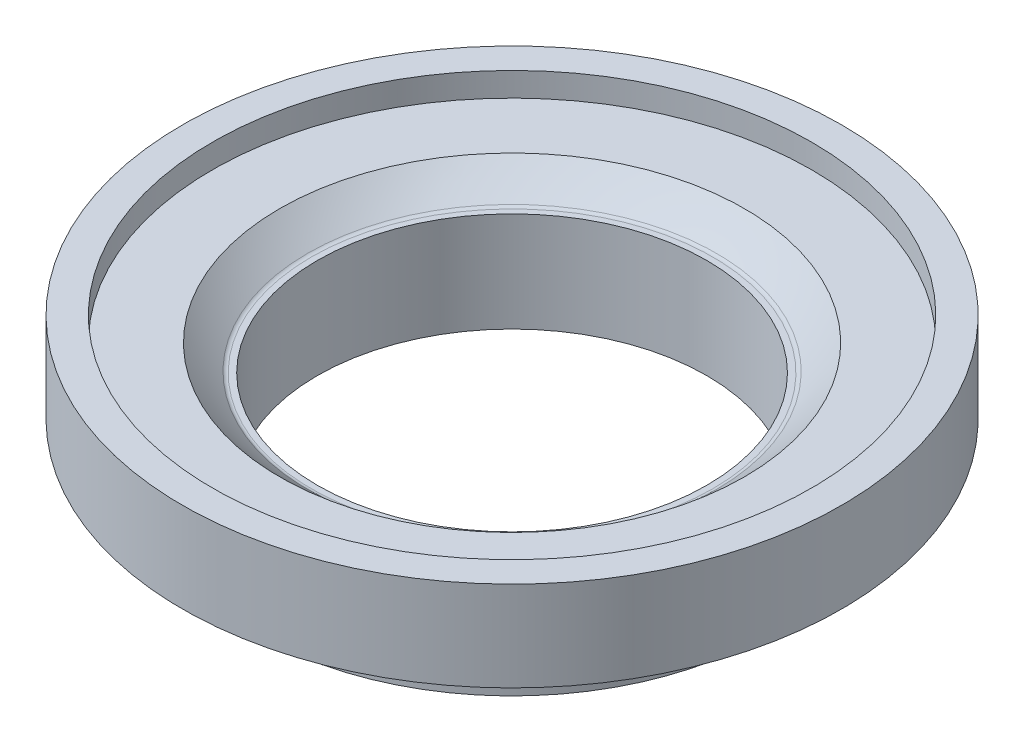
ISO-10303-21;
HEADER;
FILE_DESCRIPTION(('STEP AP214'),'2;1');
FILE_NAME('part.step','',(''),(''),'','','');
FILE_SCHEMA(('AUTOMOTIVE_DESIGN { 1 0 10303 214 1 1 1 1 }'));
ENDSEC;
DATA;
#1=APPLICATION_CONTEXT('core data for automotive mechanical design processes');
#2=APPLICATION_PROTOCOL_DEFINITION('international standard','automotive_design',2000,#1);
#3=PRODUCT_CONTEXT('',#1,'mechanical');
#4=PRODUCT('Part','Part','',(#3));
#5=PRODUCT_RELATED_PRODUCT_CATEGORY('part','',(#4));
#6=PRODUCT_DEFINITION_FORMATION('','',#4);
#7=PRODUCT_DEFINITION_CONTEXT('part definition',#1,'design');
#8=PRODUCT_DEFINITION('design','',#6,#7);
#9=PRODUCT_DEFINITION_SHAPE('','',#8);
#10=(LENGTH_UNIT() NAMED_UNIT(*) SI_UNIT(.MILLI.,.METRE.));
#11=(NAMED_UNIT(*) PLANE_ANGLE_UNIT() SI_UNIT($,.RADIAN.));
#12=(NAMED_UNIT(*) SI_UNIT($,.STERADIAN.) SOLID_ANGLE_UNIT());
#13=UNCERTAINTY_MEASURE_WITH_UNIT(LENGTH_MEASURE(1.E-05),#10,'distance_accuracy_value','');
#14=(GEOMETRIC_REPRESENTATION_CONTEXT(3) GLOBAL_UNCERTAINTY_ASSIGNED_CONTEXT((#13)) GLOBAL_UNIT_ASSIGNED_CONTEXT((#10,
#11,#12)) REPRESENTATION_CONTEXT('',''));
#15=CARTESIAN_POINT('',(0.,0.,0.));
#16=DIRECTION('',(0.,0.,1.));
#17=DIRECTION('',(1.,0.,0.));
#18=AXIS2_PLACEMENT_3D('',#15,#16,#17);
#19=CARTESIAN_POINT('',(0.,0.,0.));
#20=DIRECTION('',(0.,-1.,0.));
#21=DIRECTION('',(0.,0.,-1.));
#22=AXIS2_PLACEMENT_3D('',#19,#20,#21);
#23=CYLINDRICAL_SURFACE('',#22,6.49999999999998);
#24=CARTESIAN_POINT('',(0.,0.,0.));
#25=DIRECTION('',(0.,-1.,0.));
#26=DIRECTION('',(0.,0.,-1.));
#27=AXIS2_PLACEMENT_3D('',#24,#25,#26);
#28=CIRCLE('',#27,6.5);
#29=CARTESIAN_POINT('',(0.,0.,-6.5));
#30=VERTEX_POINT('',#29);
#31=EDGE_CURVE('E59',#30,#30,#28,.T.);
#32=ORIENTED_EDGE('',*,*,#31,.T.);
#33=EDGE_LOOP('',(#32));
#34=FACE_BOUND('',#33,.T.);
#35=CARTESIAN_POINT('',(0.,3.32946282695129,0.));
#36=DIRECTION('',(0.,1.,0.));
#37=DIRECTION('',(-1.,0.,0.));
#38=AXIS2_PLACEMENT_3D('',#35,#36,#37);
#39=CIRCLE('',#38,6.5);
#40=CARTESIAN_POINT('',(-6.5,3.32946282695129,0.));
#41=VERTEX_POINT('',#40);
#42=EDGE_CURVE('E71',#41,#41,#39,.T.);
#43=ORIENTED_EDGE('',*,*,#42,.T.);
#44=EDGE_LOOP('',(#43));
#45=FACE_BOUND('',#44,.T.);
#46=ADVANCED_FACE('F30',(#34,#45),#23,.F.);
#47=CARTESIAN_POINT('',(-8.5,0.,0.));
#48=DIRECTION('',(0.,-1.,0.));
#49=DIRECTION('',(0.,0.,-1.));
#50=AXIS2_PLACEMENT_3D('',#47,#48,#49);
#51=PLANE('',#50);
#52=CARTESIAN_POINT('',(0.,0.,0.));
#53=DIRECTION('',(0.,-1.,0.));
#54=DIRECTION('',(0.,0.,-1.));
#55=AXIS2_PLACEMENT_3D('',#52,#53,#54);
#56=CIRCLE('',#55,8.5);
#57=CARTESIAN_POINT('',(0.,0.,-8.5));
#58=VERTEX_POINT('',#57);
#59=EDGE_CURVE('E10',#58,#58,#56,.T.);
#60=ORIENTED_EDGE('',*,*,#59,.T.);
#61=EDGE_LOOP('',(#60));
#62=FACE_BOUND('',#61,.T.);
#63=ORIENTED_EDGE('',*,*,#31,.F.);
#64=EDGE_LOOP('',(#63));
#65=FACE_BOUND('',#64,.T.);
#66=ADVANCED_FACE('F94',(#62,#65),#51,.T.);
#67=CARTESIAN_POINT('',(0.,0.,0.));
#68=DIRECTION('',(0.,-1.,0.));
#69=DIRECTION('',(0.,0.,-1.));
#70=AXIS2_PLACEMENT_3D('',#67,#68,#69);
#71=CYLINDRICAL_SURFACE('',#70,8.5);
#72=CARTESIAN_POINT('',(0.,1.,0.));
#73=DIRECTION('',(0.,-1.,0.));
#74=DIRECTION('',(0.,0.,-1.));
#75=AXIS2_PLACEMENT_3D('',#72,#73,#74);
#76=CIRCLE('',#75,8.5);
#77=CARTESIAN_POINT('',(0.,1.,-8.5));
#78=VERTEX_POINT('',#77);
#79=EDGE_CURVE('E37',#78,#78,#76,.T.);
#80=ORIENTED_EDGE('',*,*,#79,.T.);
#81=EDGE_LOOP('',(#80));
#82=FACE_BOUND('',#81,.T.);
#83=ORIENTED_EDGE('',*,*,#59,.F.);
#84=EDGE_LOOP('',(#83));
#85=FACE_BOUND('',#84,.T.);
#86=ADVANCED_FACE('F32',(#82,#85),#71,.T.);
#87=CARTESIAN_POINT('',(0.,1.,0.));
#88=DIRECTION('',(0.,1.,0.));
#89=DIRECTION('',(0.,0.,1.));
#90=AXIS2_PLACEMENT_3D('',#87,#88,#89);
#91=CONICAL_SURFACE('',#90,8.5,0.78539816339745);
#92=CARTESIAN_POINT('',(0.,2.,0.));
#93=DIRECTION('',(0.,-1.,0.));
#94=DIRECTION('',(0.,0.,-1.));
#95=AXIS2_PLACEMENT_3D('',#92,#93,#94);
#96=CIRCLE('',#95,9.5);
#97=CARTESIAN_POINT('',(0.,2.,-9.5));
#98=VERTEX_POINT('',#97);
#99=EDGE_CURVE('E41',#98,#98,#96,.T.);
#100=ORIENTED_EDGE('',*,*,#99,.T.);
#101=EDGE_LOOP('',(#100));
#102=FACE_BOUND('',#101,.T.);
#103=ORIENTED_EDGE('',*,*,#79,.F.);
#104=EDGE_LOOP('',(#103));
#105=FACE_BOUND('',#104,.T.);
#106=ADVANCED_FACE('F119',(#102,#105),#91,.T.);
#107=CARTESIAN_POINT('',(-9.5,2.,0.));
#108=DIRECTION('',(0.,-1.,0.));
#109=DIRECTION('',(0.,0.,-1.));
#110=AXIS2_PLACEMENT_3D('',#107,#108,#109);
#111=PLANE('',#110);
#112=CARTESIAN_POINT('',(0.,2.,0.));
#113=DIRECTION('',(0.,-1.,0.));
#114=DIRECTION('',(0.,0.,-1.));
#115=AXIS2_PLACEMENT_3D('',#112,#113,#114);
#116=CIRCLE('',#115,11.);
#117=CARTESIAN_POINT('',(0.,2.,-11.));
#118=VERTEX_POINT('',#117);
#119=EDGE_CURVE('E45',#118,#118,#116,.T.);
#120=ORIENTED_EDGE('',*,*,#119,.T.);
#121=EDGE_LOOP('',(#120));
#122=FACE_BOUND('',#121,.T.);
#123=ORIENTED_EDGE('',*,*,#99,.F.);
#124=EDGE_LOOP('',(#123));
#125=FACE_BOUND('',#124,.T.);
#126=ADVANCED_FACE('F116',(#122,#125),#111,.T.);
#127=CARTESIAN_POINT('',(0.,0.,0.));
#128=DIRECTION('',(0.,-1.,0.));
#129=DIRECTION('',(0.,0.,-1.));
#130=AXIS2_PLACEMENT_3D('',#127,#128,#129);
#131=CYLINDRICAL_SURFACE('',#130,11.);
#132=CARTESIAN_POINT('',(0.,5.,0.));
#133=DIRECTION('',(0.,-1.,0.));
#134=DIRECTION('',(0.,0.,-1.));
#135=AXIS2_PLACEMENT_3D('',#132,#133,#134);
#136=CIRCLE('',#135,11.);
#137=CARTESIAN_POINT('',(0.,5.,-11.));
#138=VERTEX_POINT('',#137);
#139=EDGE_CURVE('E50',#138,#138,#136,.T.);
#140=ORIENTED_EDGE('',*,*,#139,.T.);
#141=EDGE_LOOP('',(#140));
#142=FACE_BOUND('',#141,.T.);
#143=ORIENTED_EDGE('',*,*,#119,.F.);
#144=EDGE_LOOP('',(#143));
#145=FACE_BOUND('',#144,.T.);
#146=ADVANCED_FACE('F112',(#142,#145),#131,.T.);
#147=CARTESIAN_POINT('',(-11.,5.,0.));
#148=DIRECTION('',(0.,1.,0.));
#149=DIRECTION('',(0.,0.,1.));
#150=AXIS2_PLACEMENT_3D('',#147,#148,#149);
#151=PLANE('',#150);
#152=CARTESIAN_POINT('',(0.,5.,0.));
#153=DIRECTION('',(0.,-1.,0.));
#154=DIRECTION('',(0.,0.,-1.));
#155=AXIS2_PLACEMENT_3D('',#152,#153,#154);
#156=CIRCLE('',#155,10.);
#157=CARTESIAN_POINT('',(0.,5.,-10.));
#158=VERTEX_POINT('',#157);
#159=EDGE_CURVE('E53',#158,#158,#156,.T.);
#160=ORIENTED_EDGE('',*,*,#159,.T.);
#161=EDGE_LOOP('',(#160));
#162=FACE_BOUND('',#161,.T.);
#163=ORIENTED_EDGE('',*,*,#139,.F.);
#164=EDGE_LOOP('',(#163));
#165=FACE_BOUND('',#164,.T.);
#166=ADVANCED_FACE('F108',(#162,#165),#151,.T.);
#167=CARTESIAN_POINT('',(0.,0.,0.));
#168=DIRECTION('',(0.,-1.,0.));
#169=DIRECTION('',(0.,0.,-1.));
#170=AXIS2_PLACEMENT_3D('',#167,#168,#169);
#171=CYLINDRICAL_SURFACE('',#170,10.);
#172=CARTESIAN_POINT('',(0.,4.2,0.));
#173=DIRECTION('',(0.,-1.,0.));
#174=DIRECTION('',(0.,0.,-1.));
#175=AXIS2_PLACEMENT_3D('',#172,#173,#174);
#176=CIRCLE('',#175,10.);
#177=CARTESIAN_POINT('',(0.,4.2,-10.));
#178=VERTEX_POINT('',#177);
#179=EDGE_CURVE('E56',#178,#178,#176,.T.);
#180=ORIENTED_EDGE('',*,*,#179,.T.);
#181=EDGE_LOOP('',(#180));
#182=FACE_BOUND('',#181,.T.);
#183=ORIENTED_EDGE('',*,*,#159,.F.);
#184=EDGE_LOOP('',(#183));
#185=FACE_BOUND('',#184,.T.);
#186=ADVANCED_FACE('F104',(#182,#185),#171,.F.);
#187=CARTESIAN_POINT('',(-10.,4.19999999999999,0.));
#188=DIRECTION('',(0.,1.,0.));
#189=DIRECTION('',(0.,0.,1.));
#190=AXIS2_PLACEMENT_3D('',#187,#188,#189);
#191=PLANE('',#190);
#192=CARTESIAN_POINT('',(0.,4.19999999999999,0.));
#193=DIRECTION('',(0.,1.,0.));
#194=DIRECTION('',(0.,0.,1.));
#195=AXIS2_PLACEMENT_3D('',#192,#193,#194);
#196=CIRCLE('',#195,7.75628777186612);
#197=CARTESIAN_POINT('',(7.75628777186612,4.19999999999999,0.));
#198=VERTEX_POINT('',#197);
#199=EDGE_CURVE('E62',#198,#198,#196,.T.);
#200=ORIENTED_EDGE('',*,*,#199,.F.);
#201=EDGE_LOOP('',(#200));
#202=FACE_BOUND('',#201,.T.);
#203=ORIENTED_EDGE('',*,*,#179,.F.);
#204=EDGE_LOOP('',(#203));
#205=FACE_BOUND('',#204,.T.);
#206=ADVANCED_FACE('F90',(#202,#205),#191,.T.);
#207=CARTESIAN_POINT('',(0.,12.,0.));
#208=DIRECTION('',(0.,-1.,0.));
#209=DIRECTION('',(1.,0.,0.));
#210=AXIS2_PLACEMENT_3D('',#207,#208,#209);
#211=SPHERICAL_SURFACE('',#210,11.);
#212=CARTESIAN_POINT('',(0.,3.37260102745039,0.));
#213=DIRECTION('',(0.,1.,0.));
#214=DIRECTION('',(0.,0.,1.));
#215=AXIS2_PLACEMENT_3D('',#212,#213,#214);
#216=CIRCLE('',#215,6.82407407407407);
#217=CARTESIAN_POINT('',(6.82407407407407,3.37260102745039,0.));
#218=VERTEX_POINT('',#217);
#219=EDGE_CURVE('E65',#218,#218,#216,.T.);
#220=CARTESIAN_POINT('',(7.75628777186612,4.19999999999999,0.));
#221=CARTESIAN_POINT('',(7.74707618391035,4.19084003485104,0.));
#222=CARTESIAN_POINT('',(7.73784836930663,4.18169638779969,0.));
#223=CARTESIAN_POINT('',(7.71936040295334,4.16344184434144,0.));
#224=CARTESIAN_POINT('',(7.71010025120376,4.15433094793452,0.));
#225=CARTESIAN_POINT('',(7.69154772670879,4.13614202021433,0.));
#226=CARTESIAN_POINT('',(7.6822553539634,4.12706398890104,0.));
#227=CARTESIAN_POINT('',(7.66363850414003,4.10894090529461,0.));
#228=CARTESIAN_POINT('',(7.65431402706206,4.09989585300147,0.));
#229=CARTESIAN_POINT('',(7.63563308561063,4.0818388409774,0.));
#230=CARTESIAN_POINT('',(7.62627662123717,4.07282688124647,0.));
#231=CARTESIAN_POINT('',(7.60753182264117,4.05483616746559,0.));
#232=CARTESIAN_POINT('',(7.59814348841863,4.04585741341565,0.));
#233=CARTESIAN_POINT('',(7.57933506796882,4.02793322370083,0.));
#234=CARTESIAN_POINT('',(7.56991498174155,4.01898778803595,0.));
#235=CARTESIAN_POINT('',(7.55104317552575,4.00113034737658,0.));
#236=CARTESIAN_POINT('',(7.54159145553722,3.99221834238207,0.));
#237=CARTESIAN_POINT('',(7.5226565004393,3.97442787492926,0.));
#238=CARTESIAN_POINT('',(7.51317326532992,3.96554941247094,0.));
#239=CARTESIAN_POINT('',(7.4941753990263,3.94782614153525,0.));
#240=CARTESIAN_POINT('',(7.48466076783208,3.93898133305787,0.));
#241=CARTESIAN_POINT('',(7.46560022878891,3.92132548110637,0.));
#242=CARTESIAN_POINT('',(7.45605432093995,3.91251443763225,0.));
#243=CARTESIAN_POINT('',(7.43693134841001,3.89492622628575,0.));
#244=CARTESIAN_POINT('',(7.42735428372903,3.88614905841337,0.));
#245=CARTESIAN_POINT('',(7.40816911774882,3.86862870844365,0.));
#246=CARTESIAN_POINT('',(7.3985610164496,3.8598855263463,0.));
#247=CARTESIAN_POINT('',(7.37931389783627,3.8424332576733,0.));
#248=CARTESIAN_POINT('',(7.36967488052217,3.83372417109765,0.));
#249=CARTESIAN_POINT('',(7.35036605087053,3.81634020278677,0.));
#250=CARTESIAN_POINT('',(7.34069623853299,3.80766532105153,0.));
#251=CARTESIAN_POINT('',(7.32132594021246,3.79034987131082,0.));
#252=CARTESIAN_POINT('',(7.31162545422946,3.78170930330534,0.));
#253=CARTESIAN_POINT('',(7.29219393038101,3.76446258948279,0.));
#254=CARTESIAN_POINT('',(7.28246289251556,3.75585644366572,0.));
#255=CARTESIAN_POINT('',(7.2629703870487,3.73867868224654,0.));
#256=CARTESIAN_POINT('',(7.25320891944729,3.73010706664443,0.));
#257=CARTESIAN_POINT('',(7.23365567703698,3.71299847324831,0.));
#258=CARTESIAN_POINT('',(7.22386390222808,3.70446149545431,0.));
#259=CARTESIAN_POINT('',(7.20425016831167,3.68742228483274,0.));
#260=CARTESIAN_POINT('',(7.19442820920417,3.67892005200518,0.));
#261=CARTESIAN_POINT('',(7.17475422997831,3.66195043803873,0.));
#262=CARTESIAN_POINT('',(7.16490220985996,3.65348305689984,0.));
#263=CARTESIAN_POINT('',(7.14516823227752,3.63658325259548,0.));
#264=CARTESIAN_POINT('',(7.13528627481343,3.62815082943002,0.));
#265=CARTESIAN_POINT('',(7.11549254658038,3.61132104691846,0.));
#266=CARTESIAN_POINT('',(7.10558077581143,3.60292368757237,0.));
#267=CARTESIAN_POINT('',(7.08572754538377,3.58616413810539,0.));
#268=CARTESIAN_POINT('',(7.07578608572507,3.5778019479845,0.));
#269=CARTESIAN_POINT('',(7.05587360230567,3.56111284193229,0.));
#270=CARTESIAN_POINT('',(7.04590257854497,3.55278592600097,0.));
#271=CARTESIAN_POINT('',(7.02593109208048,3.53616747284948,0.));
#272=CARTESIAN_POINT('',(7.01593062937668,3.5278759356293,0.));
#273=CARTESIAN_POINT('',(6.99590039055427,3.51132834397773,0.));
#274=CARTESIAN_POINT('',(6.98587061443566,3.50307228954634,0.));
#275=CARTESIAN_POINT('',(6.96578187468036,3.48659576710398,0.));
#276=CARTESIAN_POINT('',(6.95572291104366,3.47837529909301,0.));
#277=CARTESIAN_POINT('',(6.93557592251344,3.46197005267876,0.));
#278=CARTESIAN_POINT('',(6.9254878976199,3.45378527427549,0.));
#279=CARTESIAN_POINT('',(6.90528291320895,3.43745150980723,0.));
#280=CARTESIAN_POINT('',(6.89516595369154,3.42930252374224,0.));
#281=CARTESIAN_POINT('',(6.87490322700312,3.41304044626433,0.));
#282=CARTESIAN_POINT('',(6.86475745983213,3.40492735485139,0.));
#283=CARTESIAN_POINT('',(6.84443724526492,3.38873716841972,0.));
#284=CARTESIAN_POINT('',(6.83426279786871,3.38066007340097,0.));
#285=CARTESIAN_POINT('',(6.82407407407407,3.37260102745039,0.));
#286=B_SPLINE_CURVE_WITH_KNOTS('',3,(#220,#221,#222,#223,#224,#225,#226,#227,#228,#229,#230,
#231,#232,#233,#234,#235,#236,#237,#238,#239,#240,#241,#242,#243,#244,#245,#246,#247,#248,#249,
#250,#251,#252,#253,#254,#255,#256,#257,#258,#259,#260,#261,#262,#263,#264,#265,#266,#267,#268,
#269,#270,#271,#272,#273,#274,#275,#276,#277,#278,#279,#280,#281,#282,#283,#284,#285),
.UNSPECIFIED.,.F.,.F.,(4,2,2,2,2,2,2,2,2,2,2,2,2,2,2,2,2,2,2,2,2,2,2,2,2,2,2,2,2,2,2,2,4),(0.,
0.0389720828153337,0.0779441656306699,0.116916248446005,0.15588833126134,0.194860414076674,
0.233832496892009,0.272804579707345,0.311776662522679,0.350748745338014,0.38972082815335,
0.428692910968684,0.46766499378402,0.506637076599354,0.54560915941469,0.584581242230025,
0.62355332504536,0.662525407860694,0.701497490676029,0.740469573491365,0.779441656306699,
0.818413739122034,0.857385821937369,0.896357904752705,0.93532998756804,0.974302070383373,
1.01327415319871,1.05224623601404,1.09121831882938,1.13019040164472,1.16916248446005,
1.20813456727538,1.24710665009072),.UNSPECIFIED.);
#287=EDGE_CURVE('BSEAM84',#198,#218,#286,.T.);
#288=ORIENTED_EDGE('',*,*,#199,.T.);
#289=ORIENTED_EDGE('',*,*,#219,.F.);
#290=ORIENTED_EDGE('',*,*,#287,.T.);
#291=ORIENTED_EDGE('',*,*,#287,.F.);
#292=EDGE_LOOP('',(#288,#290,#289,#291));
#293=FACE_BOUND('',#292,.T.);
#294=ADVANCED_FACE('F84',(#293),#211,.F.);
#295=CARTESIAN_POINT('',(0.,3.52946282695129,0.));
#296=DIRECTION('',(0.,1.,0.));
#297=DIRECTION('',(0.,0.,1.));
#298=AXIS2_PLACEMENT_3D('',#295,#296,#297);
#299=TOROIDAL_SURFACE('',#298,6.7,0.2);
#300=ORIENTED_EDGE('',*,*,#219,.T.);
#301=EDGE_LOOP('',(#300));
#302=FACE_BOUND('',#301,.T.);
#303=CARTESIAN_POINT('',(0.,3.32946282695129,0.));
#304=DIRECTION('',(0.,1.,0.));
#305=DIRECTION('',(-1.,0.,0.));
#306=AXIS2_PLACEMENT_3D('',#303,#304,#305);
#307=CIRCLE('',#306,6.7);
#308=CARTESIAN_POINT('',(-6.7,3.32946282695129,0.));
#309=VERTEX_POINT('',#308);
#310=EDGE_CURVE('E68',#309,#309,#307,.T.);
#311=ORIENTED_EDGE('',*,*,#310,.F.);
#312=EDGE_LOOP('',(#311));
#313=FACE_BOUND('',#312,.T.);
#314=ADVANCED_FACE('F79',(#302,#313),#299,.F.);
#315=CARTESIAN_POINT('',(6.7,3.32946282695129,0.));
#316=DIRECTION('',(0.,-1.,0.));
#317=DIRECTION('',(1.,0.,0.));
#318=AXIS2_PLACEMENT_3D('',#315,#316,#317);
#319=PLANE('',#318);
#320=ORIENTED_EDGE('',*,*,#42,.F.);
#321=EDGE_LOOP('',(#320));
#322=FACE_BOUND('',#321,.T.);
#323=ORIENTED_EDGE('',*,*,#310,.T.);
#324=EDGE_LOOP('',(#323));
#325=FACE_BOUND('',#324,.T.);
#326=ADVANCED_FACE('F76',(#322,#325),#319,.F.);
#327=CLOSED_SHELL('',(#46,#66,#86,#106,#126,#146,#166,#186,#206,#294,#314,#326));
#328=MANIFOLD_SOLID_BREP('B2',#327);
#329=ADVANCED_BREP_SHAPE_REPRESENTATION('',(#18,#328),#14);
#330=SHAPE_DEFINITION_REPRESENTATION(#9,#329);
ENDSEC;
END-ISO-10303-21;
